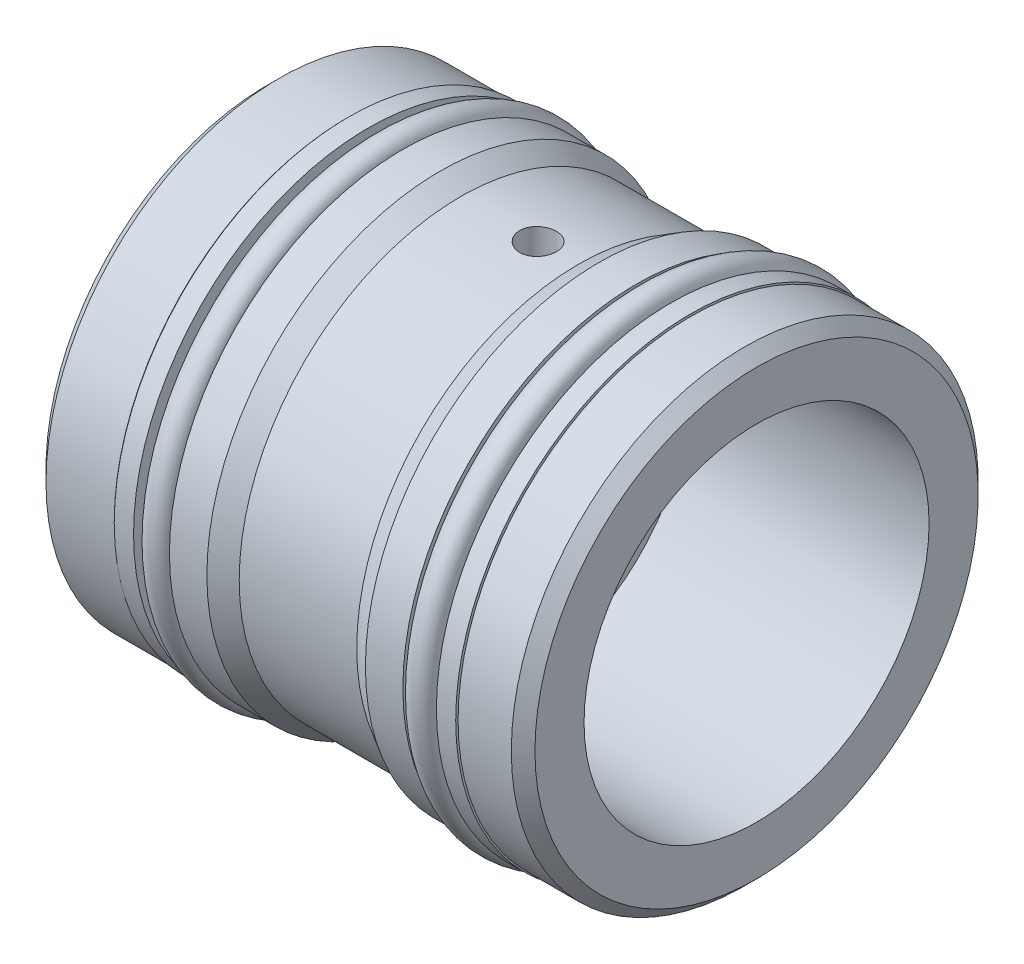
ISO-10303-21;
HEADER;
FILE_DESCRIPTION(('STEP AP214'),'2;1');
FILE_NAME('part.step','',(''),(''),'','','');
FILE_SCHEMA(('AUTOMOTIVE_DESIGN { 1 0 10303 214 1 1 1 1 }'));
ENDSEC;
DATA;
#1=APPLICATION_CONTEXT('core data for automotive mechanical design processes');
#2=APPLICATION_PROTOCOL_DEFINITION('international standard','automotive_design',2000,#1);
#3=PRODUCT_CONTEXT('',#1,'mechanical');
#4=PRODUCT('Part','Part','',(#3));
#5=PRODUCT_RELATED_PRODUCT_CATEGORY('part','',(#4));
#6=PRODUCT_DEFINITION_FORMATION('','',#4);
#7=PRODUCT_DEFINITION_CONTEXT('part definition',#1,'design');
#8=PRODUCT_DEFINITION('design','',#6,#7);
#9=PRODUCT_DEFINITION_SHAPE('','',#8);
#10=(LENGTH_UNIT() NAMED_UNIT(*) SI_UNIT(.MILLI.,.METRE.));
#11=(NAMED_UNIT(*) PLANE_ANGLE_UNIT() SI_UNIT($,.RADIAN.));
#12=(NAMED_UNIT(*) SI_UNIT($,.STERADIAN.) SOLID_ANGLE_UNIT());
#13=UNCERTAINTY_MEASURE_WITH_UNIT(LENGTH_MEASURE(1.E-05),#10,'distance_accuracy_value','');
#14=(GEOMETRIC_REPRESENTATION_CONTEXT(3) GLOBAL_UNCERTAINTY_ASSIGNED_CONTEXT((#13)) GLOBAL_UNIT_ASSIGNED_CONTEXT((#10,
#11,#12)) REPRESENTATION_CONTEXT('',''));
#15=CARTESIAN_POINT('',(0.,0.,0.));
#16=DIRECTION('',(0.,0.,1.));
#17=DIRECTION('',(1.,0.,0.));
#18=AXIS2_PLACEMENT_3D('',#15,#16,#17);
#19=CARTESIAN_POINT('',(0.,0.,0.));
#20=DIRECTION('',(-1.,0.,0.));
#21=DIRECTION('',(0.,0.,1.));
#22=AXIS2_PLACEMENT_3D('',#19,#20,#21);
#23=CYLINDRICAL_SURFACE('',#22,14.2748);
#24=CARTESIAN_POINT('',(-3.3029772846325,0.,0.));
#25=DIRECTION('',(-1.,0.,0.));
#26=DIRECTION('',(0.,0.,1.));
#27=AXIS2_PLACEMENT_3D('',#24,#25,#26);
#28=CIRCLE('',#27,14.2748);
#29=CARTESIAN_POINT('',(-3.3029772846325,0.,14.2748));
#30=VERTEX_POINT('',#29);
#31=EDGE_CURVE('E38',#30,#30,#28,.T.);
#32=ORIENTED_EDGE('',*,*,#31,.F.);
#33=EDGE_LOOP('',(#32));
#34=FACE_BOUND('',#33,.T.);
#35=CARTESIAN_POINT('',(1.6764,-14.2258538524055,1.1811));
#36=CARTESIAN_POINT('',(1.74262096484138,-14.2258545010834,1.18109710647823));
#37=CARTESIAN_POINT('',(1.80888705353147,-14.2263212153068,1.17551202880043));
#38=CARTESIAN_POINT('',(1.93958585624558,-14.2281376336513,1.1533142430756));
#39=CARTESIAN_POINT('',(2.00401640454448,-14.2294883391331,1.13668902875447));
#40=CARTESIAN_POINT('',(2.12913224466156,-14.2329187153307,1.09289497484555));
#41=CARTESIAN_POINT('',(2.18981963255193,-14.2349979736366,1.06573209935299));
#42=CARTESIAN_POINT('',(2.30575918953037,-14.2396506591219,1.00164435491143));
#43=CARTESIAN_POINT('',(2.36101251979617,-14.2422239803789,0.964721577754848));
#44=CARTESIAN_POINT('',(2.46466995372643,-14.2475821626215,0.882061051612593));
#45=CARTESIAN_POINT('',(2.51305839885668,-14.2503674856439,0.836303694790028));
#46=CARTESIAN_POINT('',(2.60147798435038,-14.2558316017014,0.737314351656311));
#47=CARTESIAN_POINT('',(2.64150876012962,-14.2585103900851,0.684082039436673));
#48=CARTESIAN_POINT('',(2.71212867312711,-14.2634639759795,0.571560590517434));
#49=CARTESIAN_POINT('',(2.74270427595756,-14.2657381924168,0.512262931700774));
#50=CARTESIAN_POINT('',(2.79345933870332,-14.2696214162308,0.389353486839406));
#51=CARTESIAN_POINT('',(2.8136389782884,-14.2712304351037,0.325741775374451));
#52=CARTESIAN_POINT('',(2.84298425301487,-14.2735987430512,0.196165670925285));
#53=CARTESIAN_POINT('',(2.8521752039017,-14.2743599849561,0.130207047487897));
#54=CARTESIAN_POINT('',(2.85936046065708,-14.2749535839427,-0.00232075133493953));
#55=CARTESIAN_POINT('',(2.85735497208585,-14.2747859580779,-0.0688899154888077));
#56=CARTESIAN_POINT('',(2.84222498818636,-14.2735423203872,-0.200577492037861));
#57=CARTESIAN_POINT('',(2.82912771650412,-14.2724685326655,-0.265699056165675));
#58=CARTESIAN_POINT('',(2.79222827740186,-14.2695359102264,-0.392816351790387));
#59=CARTESIAN_POINT('',(2.76842600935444,-14.2676770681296,-0.454812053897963));
#60=CARTESIAN_POINT('',(2.71076187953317,-14.2633796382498,-0.574004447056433));
#61=CARTESIAN_POINT('',(2.6768878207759,-14.2609403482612,-0.631195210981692));
#62=CARTESIAN_POINT('',(2.60005052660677,-14.2557561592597,-0.739089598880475));
#63=CARTESIAN_POINT('',(2.55708710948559,-14.2530112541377,-0.789793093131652));
#64=CARTESIAN_POINT('',(2.46313722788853,-14.2475146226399,-0.883432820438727));
#65=CARTESIAN_POINT('',(2.41212710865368,-14.2447629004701,-0.926345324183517));
#66=CARTESIAN_POINT('',(2.30361426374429,-14.2395710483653,-1.0030016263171));
#67=CARTESIAN_POINT('',(2.24611153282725,-14.237130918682,-1.03674541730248));
#68=CARTESIAN_POINT('',(2.12622914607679,-14.2328380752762,-1.09410550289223));
#69=CARTESIAN_POINT('',(2.0638489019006,-14.2309854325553,-1.11772057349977));
#70=CARTESIAN_POINT('',(1.93599015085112,-14.2280786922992,-1.15413534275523));
#71=CARTESIAN_POINT('',(1.87051170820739,-14.2270245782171,-1.16693526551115));
#72=CARTESIAN_POINT('',(1.73852287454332,-14.2258369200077,-1.18132637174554));
#73=CARTESIAN_POINT('',(1.67201611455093,-14.2257006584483,-1.18295064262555));
#74=CARTESIAN_POINT('',(1.53967612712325,-14.2263569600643,-1.17503100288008));
#75=CARTESIAN_POINT('',(1.47384289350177,-14.227149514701,-1.16548719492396));
#76=CARTESIAN_POINT('',(1.34481366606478,-14.2295716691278,-1.13552989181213));
#77=CARTESIAN_POINT('',(1.28161406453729,-14.2312000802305,-1.1151318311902));
#78=CARTESIAN_POINT('',(1.15953436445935,-14.2351094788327,-1.06406073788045));
#79=CARTESIAN_POINT('',(1.10065433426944,-14.2373904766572,-1.03338754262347));
#80=CARTESIAN_POINT('',(0.988733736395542,-14.2423546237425,-0.962553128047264));
#81=CARTESIAN_POINT('',(0.935707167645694,-14.245038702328,-0.922369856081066));
#82=CARTESIAN_POINT('',(0.837140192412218,-14.2505034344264,-0.833687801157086));
#83=CARTESIAN_POINT('',(0.791599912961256,-14.253284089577,-0.785188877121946));
#84=CARTESIAN_POINT('',(0.709185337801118,-14.2586367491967,-0.681109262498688));
#85=CARTESIAN_POINT('',(0.672332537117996,-14.2612082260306,-0.625511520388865));
#86=CARTESIAN_POINT('',(0.60848650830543,-14.2658451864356,-0.50889747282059));
#87=CARTESIAN_POINT('',(0.581493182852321,-14.2679106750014,-0.447881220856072));
#88=CARTESIAN_POINT('',(0.538169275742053,-14.2713005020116,-0.322239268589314));
#89=CARTESIAN_POINT('',(0.521825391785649,-14.272625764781,-0.257618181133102));
#90=CARTESIAN_POINT('',(0.500220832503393,-14.2743895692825,-0.126537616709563));
#91=CARTESIAN_POINT('',(0.494959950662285,-14.2748281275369,-0.0600781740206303));
#92=CARTESIAN_POINT('',(0.495673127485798,-14.2747691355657,0.0725806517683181));
#93=CARTESIAN_POINT('',(0.501613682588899,-14.2742743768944,0.138780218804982));
#94=CARTESIAN_POINT('',(0.524491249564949,-14.2724098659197,0.269238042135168));
#95=CARTESIAN_POINT('',(0.541428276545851,-14.2710401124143,0.33349629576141));
#96=CARTESIAN_POINT('',(0.585809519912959,-14.2675793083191,0.458249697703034));
#97=CARTESIAN_POINT('',(0.613253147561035,-14.2654882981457,0.518745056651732));
#98=CARTESIAN_POINT('',(0.677864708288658,-14.2608189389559,0.634275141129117));
#99=CARTESIAN_POINT('',(0.715032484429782,-14.2582405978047,0.689309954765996));
#100=CARTESIAN_POINT('',(0.79816301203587,-14.25287681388,0.79252814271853));
#101=CARTESIAN_POINT('',(0.844150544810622,-14.2500908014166,0.840691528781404));
#102=CARTESIAN_POINT('',(0.943570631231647,-14.2446305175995,0.928635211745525));
#103=CARTESIAN_POINT('',(0.997004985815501,-14.2419562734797,0.968413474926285));
#104=CARTESIAN_POINT('',(1.10990422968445,-14.237016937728,1.03851079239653));
#105=CARTESIAN_POINT('',(1.16938010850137,-14.2347526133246,1.0688121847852));
#106=CARTESIAN_POINT('',(1.29255353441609,-14.2308988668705,1.11895973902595));
#107=CARTESIAN_POINT('',(1.35624612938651,-14.2293086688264,1.13881792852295));
#108=CARTESIAN_POINT('',(1.46299578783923,-14.2273924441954,1.16245437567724));
#109=CARTESIAN_POINT('',(1.5053661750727,-14.2268181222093,1.16943719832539));
#110=CARTESIAN_POINT('',(1.59061806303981,-14.2260486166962,1.17876094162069));
#111=CARTESIAN_POINT('',(1.63349956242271,-14.2258534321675,1.18110187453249));
#112=CARTESIAN_POINT('',(1.6764,-14.2258538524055,1.1811));
#113=B_SPLINE_CURVE_WITH_KNOTS('',3,(#35,#36,#37,#38,#39,#40,#41,#42,#43,#44,#45,#46,#47,#48,
#49,#50,#51,#52,#53,#54,#55,#56,#57,#58,#59,#60,#61,#62,#63,#64,#65,#66,#67,#68,#69,#70,#71,#72,
#73,#74,#75,#76,#77,#78,#79,#80,#81,#82,#83,#84,#85,#86,#87,#88,#89,#90,#91,#92,#93,#94,#95,#96,
#97,#98,#99,#100,#101,#102,#103,#104,#105,#106,#107,#108,#109,#110,#111,#112),.UNSPECIFIED.,.T.,
.F.,(4,2,2,2,2,2,2,2,2,2,2,2,2,2,2,2,2,2,2,2,2,2,2,2,2,2,2,2,2,2,2,2,2,2,2,2,2,2,4),(0.,
0.198506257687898,0.397237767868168,0.595856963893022,0.794433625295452,0.993456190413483,
1.1924874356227,1.39180227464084,1.59111366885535,1.78996499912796,1.98881267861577,
2.18717371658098,2.38553661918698,2.58414072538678,2.78274880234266,2.98195199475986,
3.18115534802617,3.38038276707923,3.57960605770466,3.77823925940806,3.97687063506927,
4.17522031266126,4.3735731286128,4.57239048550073,4.77121121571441,4.97051883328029,
5.16982448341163,5.3688806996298,5.5679332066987,5.76639129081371,5.96484964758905,
6.16329688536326,6.36174092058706,6.5607509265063,6.75980914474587,6.95923616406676,
7.15843299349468,7.28703317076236,7.41563300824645),.UNSPECIFIED.);
#114=CARTESIAN_POINT('',(1.6764,-14.2258538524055,1.1811));
#115=VERTEX_POINT('',#114);
#116=EDGE_CURVE('E49',#115,#115,#113,.T.);
#117=ORIENTED_EDGE('',*,*,#116,.T.);
#118=EDGE_LOOP('',(#117));
#119=FACE_BOUND('',#118,.T.);
#120=CARTESIAN_POINT('',(1.6764,14.2258538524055,1.1811));
#121=CARTESIAN_POINT('',(1.61017903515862,14.2258545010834,1.18109710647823));
#122=CARTESIAN_POINT('',(1.54391294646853,14.2263212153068,1.17551202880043));
#123=CARTESIAN_POINT('',(1.41321414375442,14.2281376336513,1.1533142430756));
#124=CARTESIAN_POINT('',(1.34878359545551,14.2294883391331,1.13668902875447));
#125=CARTESIAN_POINT('',(1.22366775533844,14.2329187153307,1.09289497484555));
#126=CARTESIAN_POINT('',(1.16298036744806,14.2349979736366,1.06573209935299));
#127=CARTESIAN_POINT('',(1.04704081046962,14.2396506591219,1.00164435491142));
#128=CARTESIAN_POINT('',(0.991787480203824,14.2422239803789,0.964721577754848));
#129=CARTESIAN_POINT('',(0.888130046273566,14.2475821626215,0.882061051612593));
#130=CARTESIAN_POINT('',(0.839741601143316,14.2503674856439,0.836303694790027));
#131=CARTESIAN_POINT('',(0.751322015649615,14.2558316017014,0.737314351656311));
#132=CARTESIAN_POINT('',(0.71129123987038,14.2585103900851,0.684082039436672));
#133=CARTESIAN_POINT('',(0.640671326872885,14.2634639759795,0.571560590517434));
#134=CARTESIAN_POINT('',(0.610095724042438,14.2657381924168,0.512262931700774));
#135=CARTESIAN_POINT('',(0.559340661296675,14.2696214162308,0.389353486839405));
#136=CARTESIAN_POINT('',(0.539161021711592,14.2712304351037,0.32574177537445));
#137=CARTESIAN_POINT('',(0.509815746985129,14.2735987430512,0.196165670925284));
#138=CARTESIAN_POINT('',(0.500624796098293,14.2743599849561,0.130207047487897));
#139=CARTESIAN_POINT('',(0.493439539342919,14.2749535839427,-0.00232075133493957));
#140=CARTESIAN_POINT('',(0.49544502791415,14.2747859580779,-0.0688899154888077));
#141=CARTESIAN_POINT('',(0.510575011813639,14.2735423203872,-0.200577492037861));
#142=CARTESIAN_POINT('',(0.523672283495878,14.2724685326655,-0.265699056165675));
#143=CARTESIAN_POINT('',(0.560571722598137,14.2695359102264,-0.392816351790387));
#144=CARTESIAN_POINT('',(0.584373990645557,14.2676770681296,-0.454812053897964));
#145=CARTESIAN_POINT('',(0.642038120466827,14.2633796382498,-0.574004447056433));
#146=CARTESIAN_POINT('',(0.675912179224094,14.2609403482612,-0.631195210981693));
#147=CARTESIAN_POINT('',(0.752749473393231,14.2557561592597,-0.739089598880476));
#148=CARTESIAN_POINT('',(0.795712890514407,14.2530112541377,-0.789793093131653));
#149=CARTESIAN_POINT('',(0.889662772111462,14.2475146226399,-0.883432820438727));
#150=CARTESIAN_POINT('',(0.940672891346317,14.2447629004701,-0.926345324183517));
#151=CARTESIAN_POINT('',(1.04918573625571,14.2395710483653,-1.0030016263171));
#152=CARTESIAN_POINT('',(1.10668846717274,14.237130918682,-1.03674541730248));
#153=CARTESIAN_POINT('',(1.2265708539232,14.2328380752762,-1.09410550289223));
#154=CARTESIAN_POINT('',(1.2889510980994,14.2309854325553,-1.11772057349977));
#155=CARTESIAN_POINT('',(1.41680984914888,14.2280786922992,-1.15413534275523));
#156=CARTESIAN_POINT('',(1.4822882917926,14.2270245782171,-1.16693526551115));
#157=CARTESIAN_POINT('',(1.61427712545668,14.2258369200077,-1.18132637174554));
#158=CARTESIAN_POINT('',(1.68078388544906,14.2257006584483,-1.18295064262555));
#159=CARTESIAN_POINT('',(1.81312387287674,14.2263569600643,-1.17503100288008));
#160=CARTESIAN_POINT('',(1.87895710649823,14.227149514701,-1.16548719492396));
#161=CARTESIAN_POINT('',(2.00798633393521,14.2295716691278,-1.13552989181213));
#162=CARTESIAN_POINT('',(2.07118593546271,14.2312000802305,-1.1151318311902));
#163=CARTESIAN_POINT('',(2.19326563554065,14.2351094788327,-1.06406073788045));
#164=CARTESIAN_POINT('',(2.25214566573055,14.2373904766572,-1.03338754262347));
#165=CARTESIAN_POINT('',(2.36406626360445,14.2423546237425,-0.962553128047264));
#166=CARTESIAN_POINT('',(2.4170928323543,14.245038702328,-0.922369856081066));
#167=CARTESIAN_POINT('',(2.51565980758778,14.2505034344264,-0.833687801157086));
#168=CARTESIAN_POINT('',(2.56120008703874,14.253284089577,-0.785188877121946));
#169=CARTESIAN_POINT('',(2.64361466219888,14.2586367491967,-0.681109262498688));
#170=CARTESIAN_POINT('',(2.680467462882,14.2612082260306,-0.625511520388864));
#171=CARTESIAN_POINT('',(2.74431349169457,14.2658451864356,-0.50889747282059));
#172=CARTESIAN_POINT('',(2.77130681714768,14.2679106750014,-0.447881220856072));
#173=CARTESIAN_POINT('',(2.81463072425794,14.2713005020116,-0.322239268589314));
#174=CARTESIAN_POINT('',(2.83097460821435,14.272625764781,-0.257618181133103));
#175=CARTESIAN_POINT('',(2.8525791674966,14.2743895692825,-0.126537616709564));
#176=CARTESIAN_POINT('',(2.85784004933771,14.2748281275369,-0.0600781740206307));
#177=CARTESIAN_POINT('',(2.8571268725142,14.2747691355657,0.072580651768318));
#178=CARTESIAN_POINT('',(2.8511863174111,14.2742743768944,0.138780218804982));
#179=CARTESIAN_POINT('',(2.82830875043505,14.2724098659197,0.269238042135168));
#180=CARTESIAN_POINT('',(2.81137172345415,14.2710401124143,0.33349629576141));
#181=CARTESIAN_POINT('',(2.76699048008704,14.2675793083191,0.458249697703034));
#182=CARTESIAN_POINT('',(2.73954685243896,14.2654882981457,0.518745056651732));
#183=CARTESIAN_POINT('',(2.67493529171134,14.2608189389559,0.634275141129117));
#184=CARTESIAN_POINT('',(2.63776751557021,14.2582405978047,0.689309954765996));
#185=CARTESIAN_POINT('',(2.55463698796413,14.25287681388,0.79252814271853));
#186=CARTESIAN_POINT('',(2.50864945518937,14.2500908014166,0.840691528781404));
#187=CARTESIAN_POINT('',(2.40922936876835,14.2446305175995,0.928635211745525));
#188=CARTESIAN_POINT('',(2.35579501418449,14.2419562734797,0.968413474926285));
#189=CARTESIAN_POINT('',(2.24289577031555,14.237016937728,1.03851079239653));
#190=CARTESIAN_POINT('',(2.18341989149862,14.2347526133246,1.0688121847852));
#191=CARTESIAN_POINT('',(2.06024646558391,14.2308988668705,1.11895973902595));
#192=CARTESIAN_POINT('',(1.99655387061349,14.2293086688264,1.13881792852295));
#193=CARTESIAN_POINT('',(1.88980421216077,14.2273924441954,1.16245437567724));
#194=CARTESIAN_POINT('',(1.8474338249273,14.2268181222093,1.16943719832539));
#195=CARTESIAN_POINT('',(1.76218193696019,14.2260486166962,1.17876094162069));
#196=CARTESIAN_POINT('',(1.71930043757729,14.2258534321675,1.18110187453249));
#197=CARTESIAN_POINT('',(1.6764,14.2258538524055,1.1811));
#198=B_SPLINE_CURVE_WITH_KNOTS('',3,(#120,#121,#122,#123,#124,#125,#126,#127,#128,#129,#130,
#131,#132,#133,#134,#135,#136,#137,#138,#139,#140,#141,#142,#143,#144,#145,#146,#147,#148,#149,
#150,#151,#152,#153,#154,#155,#156,#157,#158,#159,#160,#161,#162,#163,#164,#165,#166,#167,#168,
#169,#170,#171,#172,#173,#174,#175,#176,#177,#178,#179,#180,#181,#182,#183,#184,#185,#186,#187,
#188,#189,#190,#191,#192,#193,#194,#195,#196,#197),.UNSPECIFIED.,.T.,.F.,(4,2,2,2,2,2,2,2,2,2,2,
2,2,2,2,2,2,2,2,2,2,2,2,2,2,2,2,2,2,2,2,2,2,2,2,2,2,2,4),(0.,0.198506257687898,
0.397237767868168,0.595856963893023,0.794433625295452,0.993456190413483,1.1924874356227,
1.39180227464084,1.59111366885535,1.78996499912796,1.98881267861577,2.18717371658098,
2.38553661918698,2.58414072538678,2.78274880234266,2.98195199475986,3.18115534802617,
3.38038276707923,3.57960605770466,3.77823925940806,3.97687063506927,4.17522031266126,
4.3735731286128,4.57239048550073,4.77121121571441,4.97051883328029,5.16982448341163,
5.3688806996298,5.5679332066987,5.76639129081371,5.96484964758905,6.16329688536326,
6.36174092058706,6.5607509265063,6.75980914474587,6.95923616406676,7.15843299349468,
7.28703317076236,7.41563300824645),.UNSPECIFIED.);
#199=CARTESIAN_POINT('',(1.6764,14.2258538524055,1.1811));
#200=VERTEX_POINT('',#199);
#201=EDGE_CURVE('E57',#200,#200,#198,.T.);
#202=ORIENTED_EDGE('',*,*,#201,.T.);
#203=EDGE_LOOP('',(#202));
#204=FACE_BOUND('',#203,.T.);
#205=CARTESIAN_POINT('',(4.2681772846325,0.,0.));
#206=DIRECTION('',(1.,0.,0.));
#207=DIRECTION('',(0.,0.,-1.));
#208=AXIS2_PLACEMENT_3D('',#205,#206,#207);
#209=CIRCLE('',#208,14.2748);
#210=CARTESIAN_POINT('',(4.2681772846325,0.,-14.2748));
#211=VERTEX_POINT('',#210);
#212=EDGE_CURVE('E10',#211,#211,#209,.T.);
#213=ORIENTED_EDGE('',*,*,#212,.F.);
#214=EDGE_LOOP('',(#213));
#215=FACE_BOUND('',#214,.T.);
#216=ADVANCED_FACE('F31',(#34,#119,#204,#215),#23,.T.);
#217=CARTESIAN_POINT('',(0.,0.,0.));
#218=DIRECTION('',(-1.,0.,0.));
#219=DIRECTION('',(0.,0.,1.));
#220=AXIS2_PLACEMENT_3D('',#217,#218,#219);
#221=CYLINDRICAL_SURFACE('',#220,13.7668);
#222=CARTESIAN_POINT('',(9.32630715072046,0.,0.));
#223=DIRECTION('',(-1.,0.,0.));
#224=DIRECTION('',(0.,0.,1.));
#225=AXIS2_PLACEMENT_3D('',#222,#223,#224);
#226=CIRCLE('',#225,13.7668);
#227=CARTESIAN_POINT('',(9.32630715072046,0.,13.7668));
#228=VERTEX_POINT('',#227);
#229=EDGE_CURVE('E207',#228,#228,#226,.T.);
#230=ORIENTED_EDGE('',*,*,#229,.F.);
#231=EDGE_LOOP('',(#230));
#232=FACE_BOUND('',#231,.T.);
#233=CARTESIAN_POINT('',(10.2362,0.,0.));
#234=DIRECTION('',(1.,0.,0.));
#235=DIRECTION('',(0.,0.,-1.));
#236=AXIS2_PLACEMENT_3D('',#233,#234,#235);
#237=CIRCLE('',#236,13.7668);
#238=CARTESIAN_POINT('',(10.2362,0.,-13.7668));
#239=VERTEX_POINT('',#238);
#240=EDGE_CURVE('E42',#239,#239,#237,.T.);
#241=ORIENTED_EDGE('',*,*,#240,.F.);
#242=EDGE_LOOP('',(#241));
#243=FACE_BOUND('',#242,.T.);
#244=ADVANCED_FACE('F122',(#232,#243),#221,.T.);
#245=CARTESIAN_POINT('',(11.557,0.,0.));
#246=DIRECTION('',(-1.,0.,0.));
#247=DIRECTION('',(0.,0.,1.));
#248=AXIS2_PLACEMENT_3D('',#245,#246,#247);
#249=CIRCLE('',#248,13.7668);
#250=CARTESIAN_POINT('',(11.557,0.,13.7668));
#251=VERTEX_POINT('',#250);
#252=EDGE_CURVE('E168',#251,#251,#249,.T.);
#253=ORIENTED_EDGE('',*,*,#252,.T.);
#254=EDGE_LOOP('',(#253));
#255=FACE_BOUND('',#254,.T.);
#256=CARTESIAN_POINT('',(11.4808,0.,0.));
#257=DIRECTION('',(-1.,0.,0.));
#258=DIRECTION('',(0.,0.,1.));
#259=AXIS2_PLACEMENT_3D('',#256,#257,#258);
#260=CIRCLE('',#259,13.7668);
#261=CARTESIAN_POINT('',(11.4808,0.,13.7668));
#262=VERTEX_POINT('',#261);
#263=EDGE_CURVE('E46',#262,#262,#260,.T.);
#264=ORIENTED_EDGE('',*,*,#263,.F.);
#265=EDGE_LOOP('',(#264));
#266=FACE_BOUND('',#265,.T.);
#267=ADVANCED_FACE('F127',(#255,#266),#221,.T.);
#268=CARTESIAN_POINT('',(8.001,0.,0.));
#269=DIRECTION('',(-1.,0.,0.));
#270=DIRECTION('',(0.,0.,1.));
#271=AXIS2_PLACEMENT_3D('',#268,#269,#270);
#272=CIRCLE('',#271,13.7668);
#273=CARTESIAN_POINT('',(8.001,0.,13.7668));
#274=VERTEX_POINT('',#273);
#275=EDGE_CURVE('E159',#274,#274,#272,.T.);
#276=ORIENTED_EDGE('',*,*,#275,.F.);
#277=EDGE_LOOP('',(#276));
#278=FACE_BOUND('',#277,.T.);
#279=CARTESIAN_POINT('',(8.60609284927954,0.,0.));
#280=DIRECTION('',(1.,0.,0.));
#281=DIRECTION('',(0.,0.,-1.));
#282=AXIS2_PLACEMENT_3D('',#279,#280,#281);
#283=CIRCLE('',#282,13.7668);
#284=CARTESIAN_POINT('',(8.60609284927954,0.,-13.7668));
#285=VERTEX_POINT('',#284);
#286=EDGE_CURVE('E210',#285,#285,#283,.T.);
#287=ORIENTED_EDGE('',*,*,#286,.F.);
#288=EDGE_LOOP('',(#287));
#289=FACE_BOUND('',#288,.T.);
#290=ADVANCED_FACE('F130',(#278,#289),#221,.T.);
#291=CARTESIAN_POINT('',(0.,0.,0.));
#292=DIRECTION('',(-1.,0.,0.));
#293=DIRECTION('',(0.,0.,1.));
#294=AXIS2_PLACEMENT_3D('',#291,#292,#293);
#295=CYLINDRICAL_SURFACE('',#294,13.7668);
#296=CARTESIAN_POINT('',(-9.271,0.,0.));
#297=DIRECTION('',(-1.,0.,0.));
#298=DIRECTION('',(0.,0.,1.));
#299=AXIS2_PLACEMENT_3D('',#296,#297,#298);
#300=CIRCLE('',#299,13.7668);
#301=CARTESIAN_POINT('',(-9.271,0.,13.7668));
#302=VERTEX_POINT('',#301);
#303=EDGE_CURVE('E195',#302,#302,#300,.T.);
#304=ORIENTED_EDGE('',*,*,#303,.F.);
#305=EDGE_LOOP('',(#304));
#306=FACE_BOUND('',#305,.T.);
#307=CARTESIAN_POINT('',(-8.36110715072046,0.,0.));
#308=DIRECTION('',(1.,0.,0.));
#309=DIRECTION('',(0.,0.,-1.));
#310=AXIS2_PLACEMENT_3D('',#307,#308,#309);
#311=CIRCLE('',#310,13.7668);
#312=CARTESIAN_POINT('',(-8.36110715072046,0.,-13.7668));
#313=VERTEX_POINT('',#312);
#314=EDGE_CURVE('E204',#313,#313,#311,.T.);
#315=ORIENTED_EDGE('',*,*,#314,.F.);
#316=EDGE_LOOP('',(#315));
#317=FACE_BOUND('',#316,.T.);
#318=ADVANCED_FACE('F222',(#306,#317),#295,.T.);
#319=CARTESIAN_POINT('',(-7.0358,0.,0.));
#320=DIRECTION('',(-1.,0.,0.));
#321=DIRECTION('',(0.,0.,1.));
#322=AXIS2_PLACEMENT_3D('',#319,#320,#321);
#323=CIRCLE('',#322,13.7668);
#324=CARTESIAN_POINT('',(-7.0358,0.,13.7668));
#325=VERTEX_POINT('',#324);
#326=EDGE_CURVE('E162',#325,#325,#323,.T.);
#327=ORIENTED_EDGE('',*,*,#326,.T.);
#328=EDGE_LOOP('',(#327));
#329=FACE_BOUND('',#328,.T.);
#330=CARTESIAN_POINT('',(-7.64089284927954,0.,0.));
#331=DIRECTION('',(-1.,0.,0.));
#332=DIRECTION('',(0.,0.,1.));
#333=AXIS2_PLACEMENT_3D('',#330,#331,#332);
#334=CIRCLE('',#333,13.7668);
#335=CARTESIAN_POINT('',(-7.64089284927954,0.,13.7668));
#336=VERTEX_POINT('',#335);
#337=EDGE_CURVE('E201',#336,#336,#334,.T.);
#338=ORIENTED_EDGE('',*,*,#337,.F.);
#339=EDGE_LOOP('',(#338));
#340=FACE_BOUND('',#339,.T.);
#341=ADVANCED_FACE('F270',(#329,#340),#295,.T.);
#342=CARTESIAN_POINT('',(-10.5918,0.,0.));
#343=DIRECTION('',(-1.,0.,0.));
#344=DIRECTION('',(0.,0.,1.));
#345=AXIS2_PLACEMENT_3D('',#342,#343,#344);
#346=CIRCLE('',#345,13.7668);
#347=CARTESIAN_POINT('',(-10.5918,0.,13.7668));
#348=VERTEX_POINT('',#347);
#349=EDGE_CURVE('E259',#348,#348,#346,.T.);
#350=ORIENTED_EDGE('',*,*,#349,.F.);
#351=EDGE_LOOP('',(#350));
#352=FACE_BOUND('',#351,.T.);
#353=CARTESIAN_POINT('',(-10.5156,0.,0.));
#354=DIRECTION('',(1.,0.,0.));
#355=DIRECTION('',(0.,0.,-1.));
#356=AXIS2_PLACEMENT_3D('',#353,#354,#355);
#357=CIRCLE('',#356,13.7668);
#358=CARTESIAN_POINT('',(-10.5156,0.,-13.7668));
#359=VERTEX_POINT('',#358);
#360=EDGE_CURVE('E198',#359,#359,#357,.T.);
#361=ORIENTED_EDGE('',*,*,#360,.F.);
#362=EDGE_LOOP('',(#361));
#363=FACE_BOUND('',#362,.T.);
#364=ADVANCED_FACE('F104',(#352,#363),#295,.T.);
#365=CARTESIAN_POINT('',(0.,0.,0.));
#366=DIRECTION('',(-1.,0.,0.));
#367=DIRECTION('',(0.,0.,1.));
#368=AXIS2_PLACEMENT_3D('',#365,#366,#367);
#369=CYLINDRICAL_SURFACE('',#368,6.35);
#370=CARTESIAN_POINT('',(0.355599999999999,0.,0.));
#371=DIRECTION('',(-1.,0.,0.));
#372=DIRECTION('',(0.,0.,1.));
#373=AXIS2_PLACEMENT_3D('',#370,#371,#372);
#374=CIRCLE('',#373,6.35);
#375=CARTESIAN_POINT('',(0.355599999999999,0.,6.35));
#376=VERTEX_POINT('',#375);
#377=EDGE_CURVE('E180',#376,#376,#374,.T.);
#378=ORIENTED_EDGE('',*,*,#377,.F.);
#379=EDGE_LOOP('',(#378));
#380=FACE_BOUND('',#379,.T.);
#381=CARTESIAN_POINT('',(-15.748,0.,0.));
#382=DIRECTION('',(-1.,0.,0.));
#383=DIRECTION('',(0.,0.,1.));
#384=AXIS2_PLACEMENT_3D('',#381,#382,#383);
#385=CIRCLE('',#384,6.35);
#386=CARTESIAN_POINT('',(-15.748,0.,6.35));
#387=VERTEX_POINT('',#386);
#388=EDGE_CURVE('E253',#387,#387,#385,.T.);
#389=ORIENTED_EDGE('',*,*,#388,.T.);
#390=EDGE_LOOP('',(#389));
#391=FACE_BOUND('',#390,.T.);
#392=ADVANCED_FACE('F101',(#380,#391),#369,.F.);
#393=CARTESIAN_POINT('',(0.355599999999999,6.35,0.));
#394=DIRECTION('',(-1.,0.,0.));
#395=DIRECTION('',(0.,0.,1.));
#396=AXIS2_PLACEMENT_3D('',#393,#394,#395);
#397=PLANE('',#396);
#398=CARTESIAN_POINT('',(0.355599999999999,0.,0.));
#399=DIRECTION('',(-1.,0.,0.));
#400=DIRECTION('',(0.,0.,1.));
#401=AXIS2_PLACEMENT_3D('',#398,#399,#400);
#402=CIRCLE('',#401,11.1125);
#403=CARTESIAN_POINT('',(0.355599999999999,0.,11.1125));
#404=VERTEX_POINT('',#403);
#405=EDGE_CURVE('E177',#404,#404,#402,.T.);
#406=ORIENTED_EDGE('',*,*,#405,.F.);
#407=EDGE_LOOP('',(#406));
#408=FACE_BOUND('',#407,.T.);
#409=ORIENTED_EDGE('',*,*,#377,.T.);
#410=EDGE_LOOP('',(#409));
#411=FACE_BOUND('',#410,.T.);
#412=ADVANCED_FACE('F95',(#408,#411),#397,.F.);
#413=CARTESIAN_POINT('',(0.,0.,0.));
#414=DIRECTION('',(-1.,0.,0.));
#415=DIRECTION('',(0.,0.,1.));
#416=AXIS2_PLACEMENT_3D('',#413,#414,#415);
#417=CYLINDRICAL_SURFACE('',#416,11.1125);
#418=CARTESIAN_POINT('',(1.6764,-11.0495546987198,1.1811));
#419=CARTESIAN_POINT('',(1.61025843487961,-11.0495555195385,1.18109714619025));
#420=CARTESIAN_POINT('',(1.5440736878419,-11.0501549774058,1.17552539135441));
#421=CARTESIAN_POINT('',(1.4135407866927,-11.0524875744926,1.15338363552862));
#422=CARTESIAN_POINT('',(1.34919471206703,-11.054221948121,1.13680165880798));
#423=CARTESIAN_POINT('',(1.22424827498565,-11.0586257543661,1.09312916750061));
#424=CARTESIAN_POINT('',(1.16364560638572,-11.0612946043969,1.06604519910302));
#425=CARTESIAN_POINT('',(1.04785884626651,-11.0672659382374,1.00215046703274));
#426=CARTESIAN_POINT('',(0.992673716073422,-11.0705683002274,0.965341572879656));
#427=CARTESIAN_POINT('',(0.889050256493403,-11.0774496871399,0.882880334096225));
#428=CARTESIAN_POINT('',(0.840637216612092,-11.0810296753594,0.837196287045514));
#429=CARTESIAN_POINT('',(0.752150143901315,-11.0880542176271,0.73834944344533));
#430=CARTESIAN_POINT('',(0.712076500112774,-11.0914987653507,0.685186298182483));
#431=CARTESIAN_POINT('',(0.641317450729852,-11.097873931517,0.57273433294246));
#432=CARTESIAN_POINT('',(0.610654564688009,-11.1008033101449,0.5134312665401));
#433=CARTESIAN_POINT('',(0.559731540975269,-11.105807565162,0.39048157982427));
#434=CARTESIAN_POINT('',(0.53947111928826,-11.1078824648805,0.326835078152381));
#435=CARTESIAN_POINT('',(0.510002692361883,-11.1109372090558,0.197261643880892));
#436=CARTESIAN_POINT('',(0.500753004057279,-11.1119211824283,0.131344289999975));
#437=CARTESIAN_POINT('',(0.493439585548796,-11.11269726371,-0.00111401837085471));
#438=CARTESIAN_POINT('',(0.495375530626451,-11.1124894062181,-0.0676549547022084));
#439=CARTESIAN_POINT('',(0.510344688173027,-11.1109086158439,-0.199188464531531));
#440=CARTESIAN_POINT('',(0.523333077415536,-11.1095403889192,-0.264186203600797));
#441=CARTESIAN_POINT('',(0.559968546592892,-11.1057979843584,-0.391074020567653));
#442=CARTESIAN_POINT('',(0.583615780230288,-11.1034237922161,-0.45296405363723));
#443=CARTESIAN_POINT('',(0.640946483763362,-11.0979282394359,-0.572020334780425));
#444=CARTESIAN_POINT('',(0.674649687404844,-11.0948054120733,-0.629177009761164));
#445=CARTESIAN_POINT('',(0.751121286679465,-11.088162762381,-0.73703965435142));
#446=CARTESIAN_POINT('',(0.793889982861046,-11.0846429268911,-0.787745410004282));
#447=CARTESIAN_POINT('',(0.887530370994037,-11.0775804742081,-0.881529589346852));
#448=CARTESIAN_POINT('',(0.938441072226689,-11.0740378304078,-0.924569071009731));
#449=CARTESIAN_POINT('',(1.04678534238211,-11.0673463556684,-1.00149721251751));
#450=CARTESIAN_POINT('',(1.10421892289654,-11.0641975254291,-1.0353858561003));
#451=CARTESIAN_POINT('',(1.22400964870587,-11.0586500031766,-1.09305071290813));
#452=CARTESIAN_POINT('',(1.28636804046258,-11.0562515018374,-1.11682435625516));
#453=CARTESIAN_POINT('',(1.41422273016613,-11.0524801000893,-1.15355269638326));
#454=CARTESIAN_POINT('',(1.479718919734,-11.0511071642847,-1.16650776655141));
#455=CARTESIAN_POINT('',(1.61164766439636,-11.0495485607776,-1.1811807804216));
#456=CARTESIAN_POINT('',(1.67807408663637,-11.049357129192,-1.1829532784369));
#457=CARTESIAN_POINT('',(1.81027809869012,-11.0501679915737,-1.17535425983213));
#458=CARTESIAN_POINT('',(1.87605569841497,-11.0511702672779,-1.16598291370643));
#459=CARTESIAN_POINT('',(2.00493483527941,-11.0542503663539,-1.13640793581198));
#460=CARTESIAN_POINT('',(2.0680423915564,-11.0563256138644,-1.11623024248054));
#461=CARTESIAN_POINT('',(2.18997742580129,-11.0613157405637,-1.0656418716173));
#462=CARTESIAN_POINT('',(2.248804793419,-11.0642306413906,-1.03523093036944));
#463=CARTESIAN_POINT('',(2.36075779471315,-11.07058556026,-0.964903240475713));
#464=CARTESIAN_POINT('',(2.41386065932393,-11.0740275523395,-0.924950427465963));
#465=CARTESIAN_POINT('',(2.51262603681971,-11.0810424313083,-0.836724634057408));
#466=CARTESIAN_POINT('',(2.55828834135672,-11.0846153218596,-0.788451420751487));
#467=CARTESIAN_POINT('',(2.64106535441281,-11.091506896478,-0.684718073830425));
#468=CARTESIAN_POINT('',(2.67814441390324,-11.0948244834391,-0.629229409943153));
#469=CARTESIAN_POINT('',(2.74245677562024,-11.1008155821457,-0.512780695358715));
#470=CARTESIAN_POINT('',(2.7696902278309,-11.1034891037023,-0.451820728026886));
#471=CARTESIAN_POINT('',(2.81347826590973,-11.1078859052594,-0.326282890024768));
#472=CARTESIAN_POINT('',(2.83005416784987,-11.1096110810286,-0.261712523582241));
#473=CARTESIAN_POINT('',(2.8521260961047,-11.1119246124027,-0.130685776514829));
#474=CARTESIAN_POINT('',(2.8576224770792,-11.1125130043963,-0.0642294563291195));
#475=CARTESIAN_POINT('',(2.85737398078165,-11.1124866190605,0.068333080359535));
#476=CARTESIAN_POINT('',(2.85168435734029,-11.1118777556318,0.134439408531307));
#477=CARTESIAN_POINT('',(2.82934149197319,-11.1095369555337,0.264751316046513));
#478=CARTESIAN_POINT('',(2.81268824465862,-11.1078050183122,0.328956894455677));
#479=CARTESIAN_POINT('',(2.76890665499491,-11.1034120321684,0.453642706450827));
#480=CARTESIAN_POINT('',(2.7417801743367,-11.1007511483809,0.514123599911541));
#481=CARTESIAN_POINT('',(2.6778279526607,-11.0947964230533,0.62968276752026));
#482=CARTESIAN_POINT('',(2.64100222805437,-11.0915025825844,0.684761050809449));
#483=CARTESIAN_POINT('',(2.55849016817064,-11.0846311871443,0.788234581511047));
#484=CARTESIAN_POINT('',(2.51276266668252,-11.0810523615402,0.836596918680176));
#485=CARTESIAN_POINT('',(2.41382775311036,-11.0740249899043,0.924985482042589));
#486=CARTESIAN_POINT('',(2.36061855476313,-11.0705764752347,0.96500971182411));
#487=CARTESIAN_POINT('',(2.24806302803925,-11.0641897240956,1.03567775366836));
#488=CARTESIAN_POINT('',(2.18869971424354,-11.0612529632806,1.06629462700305));
#489=CARTESIAN_POINT('',(2.06568010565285,-11.0562397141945,1.11708410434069));
#490=CARTESIAN_POINT('',(2.00202870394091,-11.054162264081,1.13726839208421));
#491=CARTESIAN_POINT('',(1.89441976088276,-11.051622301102,1.16163240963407));
#492=CARTESIAN_POINT('',(1.85114823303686,-11.0508506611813,1.16892266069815));
#493=CARTESIAN_POINT('',(1.76405745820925,-11.0498165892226,1.17865738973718));
#494=CARTESIAN_POINT('',(1.7202382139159,-11.0495541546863,1.18110189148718));
#495=CARTESIAN_POINT('',(1.6764,-11.0495546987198,1.1811));
#496=B_SPLINE_CURVE_WITH_KNOTS('',3,(#418,#419,#420,#421,#422,#423,#424,#425,#426,#427,#428,
#429,#430,#431,#432,#433,#434,#435,#436,#437,#438,#439,#440,#441,#442,#443,#444,#445,#446,#447,
#448,#449,#450,#451,#452,#453,#454,#455,#456,#457,#458,#459,#460,#461,#462,#463,#464,#465,#466,
#467,#468,#469,#470,#471,#472,#473,#474,#475,#476,#477,#478,#479,#480,#481,#482,#483,#484,#485,
#486,#487,#488,#489,#490,#491,#492,#493,#494,#495),.UNSPECIFIED.,.T.,.F.,(4,2,2,2,2,2,2,2,2,2,2,
2,2,2,2,2,2,2,2,2,2,2,2,2,2,2,2,2,2,2,2,2,2,2,2,2,2,2,4),(0.,0.198264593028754,
0.396745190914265,0.595102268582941,0.793421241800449,0.99246209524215,1.19151223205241,
1.39103503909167,1.59055239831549,1.78931202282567,1.98806587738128,2.18601750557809,
2.38397198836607,2.58231751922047,2.78066962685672,2.98000221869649,3.17933516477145,
3.37871872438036,3.57809540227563,3.77649866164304,3.97489888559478,4.17282501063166,
4.37075623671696,4.5694477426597,4.76814481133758,4.96765289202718,5.16715793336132,
5.36626269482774,5.56536108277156,5.76347848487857,5.96159598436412,6.15967828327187,
6.35776024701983,6.55678098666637,6.75584932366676,6.95548250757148,7.15489162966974,
7.28630080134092,7.41770932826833),.UNSPECIFIED.);
#497=CARTESIAN_POINT('',(1.6764,-11.0495546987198,1.1811));
#498=VERTEX_POINT('',#497);
#499=EDGE_CURVE('E84',#498,#498,#496,.T.);
#500=ORIENTED_EDGE('',*,*,#499,.T.);
#501=EDGE_LOOP('',(#500));
#502=FACE_BOUND('',#501,.T.);
#503=CARTESIAN_POINT('',(1.6764,11.0495546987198,1.1811));
#504=CARTESIAN_POINT('',(1.74254156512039,11.0495555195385,1.18109714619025));
#505=CARTESIAN_POINT('',(1.80872631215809,11.0501549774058,1.17552539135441));
#506=CARTESIAN_POINT('',(1.9392592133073,11.0524875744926,1.15338363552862));
#507=CARTESIAN_POINT('',(2.00360528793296,11.054221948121,1.13680165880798));
#508=CARTESIAN_POINT('',(2.12855172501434,11.0586257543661,1.09312916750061));
#509=CARTESIAN_POINT('',(2.18915439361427,11.0612946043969,1.06604519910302));
#510=CARTESIAN_POINT('',(2.30494115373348,11.0672659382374,1.00215046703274));
#511=CARTESIAN_POINT('',(2.36012628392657,11.0705683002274,0.965341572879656));
#512=CARTESIAN_POINT('',(2.46374974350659,11.0774496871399,0.882880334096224));
#513=CARTESIAN_POINT('',(2.5121627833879,11.0810296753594,0.837196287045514));
#514=CARTESIAN_POINT('',(2.60064985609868,11.0880542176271,0.73834944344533));
#515=CARTESIAN_POINT('',(2.64072349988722,11.0914987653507,0.685186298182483));
#516=CARTESIAN_POINT('',(2.71148254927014,11.097873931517,0.57273433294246));
#517=CARTESIAN_POINT('',(2.74214543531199,11.1008033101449,0.5134312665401));
#518=CARTESIAN_POINT('',(2.79306845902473,11.105807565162,0.39048157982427));
#519=CARTESIAN_POINT('',(2.81332888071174,11.1078824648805,0.326835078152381));
#520=CARTESIAN_POINT('',(2.84279730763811,11.1109372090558,0.197261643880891));
#521=CARTESIAN_POINT('',(2.85204699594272,11.1119211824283,0.131344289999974));
#522=CARTESIAN_POINT('',(2.8593604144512,11.11269726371,-0.00111401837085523));
#523=CARTESIAN_POINT('',(2.85742446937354,11.1124894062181,-0.0676549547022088));
#524=CARTESIAN_POINT('',(2.84245531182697,11.1109086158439,-0.199188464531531));
#525=CARTESIAN_POINT('',(2.82946692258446,11.1095403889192,-0.264186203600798));
#526=CARTESIAN_POINT('',(2.7928314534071,11.1057979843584,-0.391074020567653));
#527=CARTESIAN_POINT('',(2.76918421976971,11.1034237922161,-0.452964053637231));
#528=CARTESIAN_POINT('',(2.71185351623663,11.0979282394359,-0.572020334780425));
#529=CARTESIAN_POINT('',(2.67815031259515,11.0948054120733,-0.629177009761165));
#530=CARTESIAN_POINT('',(2.60167871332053,11.088162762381,-0.737039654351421));
#531=CARTESIAN_POINT('',(2.55891001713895,11.0846429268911,-0.787745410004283));
#532=CARTESIAN_POINT('',(2.46526962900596,11.0775804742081,-0.881529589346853));
#533=CARTESIAN_POINT('',(2.41435892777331,11.0740378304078,-0.924569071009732));
#534=CARTESIAN_POINT('',(2.30601465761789,11.0673463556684,-1.00149721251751));
#535=CARTESIAN_POINT('',(2.24858107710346,11.0641975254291,-1.0353858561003));
#536=CARTESIAN_POINT('',(2.12879035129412,11.0586500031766,-1.09305071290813));
#537=CARTESIAN_POINT('',(2.06643195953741,11.0562515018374,-1.11682435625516));
#538=CARTESIAN_POINT('',(1.93857726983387,11.0524801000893,-1.15355269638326));
#539=CARTESIAN_POINT('',(1.87308108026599,11.0511071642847,-1.16650776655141));
#540=CARTESIAN_POINT('',(1.74115233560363,11.0495485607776,-1.1811807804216));
#541=CARTESIAN_POINT('',(1.67472591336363,11.049357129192,-1.1829532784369));
#542=CARTESIAN_POINT('',(1.54252190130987,11.0501679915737,-1.17535425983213));
#543=CARTESIAN_POINT('',(1.47674430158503,11.0511702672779,-1.16598291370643));
#544=CARTESIAN_POINT('',(1.34786516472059,11.0542503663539,-1.13640793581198));
#545=CARTESIAN_POINT('',(1.28475760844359,11.0563256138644,-1.11623024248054));
#546=CARTESIAN_POINT('',(1.16282257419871,11.0613157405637,-1.0656418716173));
#547=CARTESIAN_POINT('',(1.10399520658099,11.0642306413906,-1.03523093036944));
#548=CARTESIAN_POINT('',(0.992042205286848,11.07058556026,-0.964903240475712));
#549=CARTESIAN_POINT('',(0.93893934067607,11.0740275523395,-0.924950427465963));
#550=CARTESIAN_POINT('',(0.840173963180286,11.0810424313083,-0.836724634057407));
#551=CARTESIAN_POINT('',(0.794511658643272,11.0846153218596,-0.788451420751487));
#552=CARTESIAN_POINT('',(0.711734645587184,11.091506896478,-0.684718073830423));
#553=CARTESIAN_POINT('',(0.674655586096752,11.0948244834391,-0.629229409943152));
#554=CARTESIAN_POINT('',(0.610343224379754,11.1008155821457,-0.512780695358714));
#555=CARTESIAN_POINT('',(0.583109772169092,11.1034891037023,-0.451820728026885));
#556=CARTESIAN_POINT('',(0.539321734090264,11.1078859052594,-0.326282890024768));
#557=CARTESIAN_POINT('',(0.522745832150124,11.1096110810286,-0.261712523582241));
#558=CARTESIAN_POINT('',(0.500673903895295,11.1119246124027,-0.130685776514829));
#559=CARTESIAN_POINT('',(0.4951775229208,11.1125130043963,-0.0642294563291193));
#560=CARTESIAN_POINT('',(0.495426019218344,11.1124866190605,0.0683330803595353));
#561=CARTESIAN_POINT('',(0.501115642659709,11.1118777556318,0.134439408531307));
#562=CARTESIAN_POINT('',(0.523458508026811,11.1095369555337,0.264751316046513));
#563=CARTESIAN_POINT('',(0.540111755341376,11.1078050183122,0.328956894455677));
#564=CARTESIAN_POINT('',(0.583893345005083,11.1034120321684,0.453642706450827));
#565=CARTESIAN_POINT('',(0.611019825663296,11.1007511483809,0.514123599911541));
#566=CARTESIAN_POINT('',(0.674972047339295,11.0947964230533,0.629682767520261));
#567=CARTESIAN_POINT('',(0.711797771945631,11.0915025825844,0.684761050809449));
#568=CARTESIAN_POINT('',(0.794309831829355,11.0846311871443,0.788234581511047));
#569=CARTESIAN_POINT('',(0.840037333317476,11.0810523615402,0.836596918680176));
#570=CARTESIAN_POINT('',(0.938972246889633,11.0740249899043,0.924985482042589));
#571=CARTESIAN_POINT('',(0.992181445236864,11.0705764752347,0.96500971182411));
#572=CARTESIAN_POINT('',(1.10473697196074,11.0641897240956,1.03567775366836));
#573=CARTESIAN_POINT('',(1.16410028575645,11.0612529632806,1.06629462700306));
#574=CARTESIAN_POINT('',(1.28711989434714,11.0562397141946,1.11708410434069));
#575=CARTESIAN_POINT('',(1.35077129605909,11.054162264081,1.13726839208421));
#576=CARTESIAN_POINT('',(1.45838023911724,11.051622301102,1.16163240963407));
#577=CARTESIAN_POINT('',(1.50165176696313,11.0508506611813,1.16892266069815));
#578=CARTESIAN_POINT('',(1.58874254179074,11.0498165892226,1.17865738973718));
#579=CARTESIAN_POINT('',(1.6325617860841,11.0495541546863,1.18110189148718));
#580=CARTESIAN_POINT('',(1.6764,11.0495546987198,1.1811));
#581=B_SPLINE_CURVE_WITH_KNOTS('',3,(#503,#504,#505,#506,#507,#508,#509,#510,#511,#512,#513,
#514,#515,#516,#517,#518,#519,#520,#521,#522,#523,#524,#525,#526,#527,#528,#529,#530,#531,#532,
#533,#534,#535,#536,#537,#538,#539,#540,#541,#542,#543,#544,#545,#546,#547,#548,#549,#550,#551,
#552,#553,#554,#555,#556,#557,#558,#559,#560,#561,#562,#563,#564,#565,#566,#567,#568,#569,#570,
#571,#572,#573,#574,#575,#576,#577,#578,#579,#580),.UNSPECIFIED.,.T.,.F.,(4,2,2,2,2,2,2,2,2,2,2,
2,2,2,2,2,2,2,2,2,2,2,2,2,2,2,2,2,2,2,2,2,2,2,2,2,2,2,4),(0.,0.198264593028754,
0.396745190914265,0.595102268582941,0.793421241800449,0.992462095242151,1.19151223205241,
1.39103503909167,1.59055239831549,1.78931202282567,1.98806587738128,2.18601750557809,
2.38397198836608,2.58231751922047,2.78066962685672,2.98000221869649,3.17933516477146,
3.37871872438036,3.57809540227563,3.77649866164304,3.97489888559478,4.17282501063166,
4.37075623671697,4.5694477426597,4.76814481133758,4.96765289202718,5.16715793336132,
5.36626269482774,5.56536108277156,5.76347848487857,5.96159598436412,6.15967828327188,
6.35776024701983,6.55678098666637,6.75584932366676,6.95548250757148,7.15489162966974,
7.28630080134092,7.41770932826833),.UNSPECIFIED.);
#582=CARTESIAN_POINT('',(1.6764,11.0495546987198,1.1811));
#583=VERTEX_POINT('',#582);
#584=EDGE_CURVE('E56',#583,#583,#581,.T.);
#585=ORIENTED_EDGE('',*,*,#584,.T.);
#586=EDGE_LOOP('',(#585));
#587=FACE_BOUND('',#586,.T.);
#588=CARTESIAN_POINT('',(15.748,0.,0.));
#589=DIRECTION('',(-1.,0.,0.));
#590=DIRECTION('',(0.,0.,1.));
#591=AXIS2_PLACEMENT_3D('',#588,#589,#590);
#592=CIRCLE('',#591,11.1125);
#593=CARTESIAN_POINT('',(15.748,0.,11.1125));
#594=VERTEX_POINT('',#593);
#595=EDGE_CURVE('E174',#594,#594,#592,.T.);
#596=ORIENTED_EDGE('',*,*,#595,.F.);
#597=EDGE_LOOP('',(#596));
#598=FACE_BOUND('',#597,.T.);
#599=ORIENTED_EDGE('',*,*,#405,.T.);
#600=EDGE_LOOP('',(#599));
#601=FACE_BOUND('',#600,.T.);
#602=ADVANCED_FACE('F89',(#502,#587,#598,#601),#417,.F.);
#603=CARTESIAN_POINT('',(15.748,15.0368,0.));
#604=DIRECTION('',(-1.,0.,0.));
#605=DIRECTION('',(0.,0.,1.));
#606=AXIS2_PLACEMENT_3D('',#603,#604,#605);
#607=PLANE('',#606);
#608=CARTESIAN_POINT('',(15.748,0.,0.));
#609=DIRECTION('',(-1.,0.,0.));
#610=DIRECTION('',(0.,0.,1.));
#611=AXIS2_PLACEMENT_3D('',#608,#609,#610);
#612=CIRCLE('',#611,14.2748);
#613=CARTESIAN_POINT('',(15.748,0.,14.2748));
#614=VERTEX_POINT('',#613);
#615=EDGE_CURVE('E186',#614,#614,#612,.F.);
#616=ORIENTED_EDGE('',*,*,#615,.T.);
#617=EDGE_LOOP('',(#616));
#618=FACE_BOUND('',#617,.T.);
#619=ORIENTED_EDGE('',*,*,#595,.T.);
#620=EDGE_LOOP('',(#619));
#621=FACE_BOUND('',#620,.T.);
#622=ADVANCED_FACE('F94',(#618,#621),#607,.F.);
#623=CARTESIAN_POINT('',(0.,0.,0.));
#624=DIRECTION('',(-1.,0.,0.));
#625=DIRECTION('',(0.,0.,1.));
#626=AXIS2_PLACEMENT_3D('',#623,#624,#625);
#627=CYLINDRICAL_SURFACE('',#626,15.0368);
#628=CARTESIAN_POINT('',(14.986,0.,0.));
#629=DIRECTION('',(-1.,0.,0.));
#630=DIRECTION('',(0.,0.,1.));
#631=AXIS2_PLACEMENT_3D('',#628,#629,#630);
#632=CIRCLE('',#631,15.0368);
#633=CARTESIAN_POINT('',(14.986,0.,15.0368));
#634=VERTEX_POINT('',#633);
#635=EDGE_CURVE('E183',#634,#634,#632,.T.);
#636=ORIENTED_EDGE('',*,*,#635,.T.);
#637=EDGE_LOOP('',(#636));
#638=FACE_BOUND('',#637,.T.);
#639=CARTESIAN_POINT('',(11.557,0.,0.));
#640=DIRECTION('',(-1.,0.,0.));
#641=DIRECTION('',(0.,0.,1.));
#642=AXIS2_PLACEMENT_3D('',#639,#640,#641);
#643=CIRCLE('',#642,15.0368);
#644=CARTESIAN_POINT('',(11.557,0.,15.0368));
#645=VERTEX_POINT('',#644);
#646=EDGE_CURVE('E171',#645,#645,#643,.T.);
#647=ORIENTED_EDGE('',*,*,#646,.F.);
#648=EDGE_LOOP('',(#647));
#649=FACE_BOUND('',#648,.T.);
#650=ADVANCED_FACE('F229',(#638,#649),#627,.T.);
#651=CARTESIAN_POINT('',(11.557,15.0368,0.));
#652=DIRECTION('',(1.,0.,0.));
#653=DIRECTION('',(0.,0.,-1.));
#654=AXIS2_PLACEMENT_3D('',#651,#652,#653);
#655=PLANE('',#654);
#656=ORIENTED_EDGE('',*,*,#252,.F.);
#657=EDGE_LOOP('',(#656));
#658=FACE_BOUND('',#657,.T.);
#659=ORIENTED_EDGE('',*,*,#646,.T.);
#660=EDGE_LOOP('',(#659));
#661=FACE_BOUND('',#660,.T.);
#662=ADVANCED_FACE('F227',(#658,#661),#655,.F.);
#663=CARTESIAN_POINT('',(8.001,13.7668,0.));
#664=DIRECTION('',(-1.,0.,0.));
#665=DIRECTION('',(0.,0.,1.));
#666=AXIS2_PLACEMENT_3D('',#663,#664,#665);
#667=PLANE('',#666);
#668=CARTESIAN_POINT('',(8.001,0.,0.));
#669=DIRECTION('',(-1.,0.,0.));
#670=DIRECTION('',(0.,0.,1.));
#671=AXIS2_PLACEMENT_3D('',#668,#669,#670);
#672=CIRCLE('',#671,15.0368);
#673=CARTESIAN_POINT('',(8.001,0.,15.0368));
#674=VERTEX_POINT('',#673);
#675=EDGE_CURVE('E155',#674,#674,#672,.T.);
#676=ORIENTED_EDGE('',*,*,#675,.F.);
#677=EDGE_LOOP('',(#676));
#678=FACE_BOUND('',#677,.T.);
#679=ORIENTED_EDGE('',*,*,#275,.T.);
#680=EDGE_LOOP('',(#679));
#681=FACE_BOUND('',#680,.T.);
#682=ADVANCED_FACE('F226',(#678,#681),#667,.F.);
#683=CARTESIAN_POINT('',(0.,0.,0.));
#684=DIRECTION('',(-1.,0.,0.));
#685=DIRECTION('',(0.,0.,1.));
#686=AXIS2_PLACEMENT_3D('',#683,#684,#685);
#687=CYLINDRICAL_SURFACE('',#686,15.0368);
#688=CARTESIAN_POINT('',(5.588,0.,0.));
#689=DIRECTION('',(-1.,0.,0.));
#690=DIRECTION('',(0.,0.,1.));
#691=AXIS2_PLACEMENT_3D('',#688,#689,#690);
#692=CIRCLE('',#691,15.0368);
#693=CARTESIAN_POINT('',(5.588,0.,15.0368));
#694=VERTEX_POINT('',#693);
#695=EDGE_CURVE('E153',#694,#694,#692,.T.);
#696=ORIENTED_EDGE('',*,*,#695,.F.);
#697=EDGE_LOOP('',(#696));
#698=FACE_BOUND('',#697,.T.);
#699=ORIENTED_EDGE('',*,*,#675,.T.);
#700=EDGE_LOOP('',(#699));
#701=FACE_BOUND('',#700,.T.);
#702=ADVANCED_FACE('F281',(#698,#701),#687,.T.);
#703=CARTESIAN_POINT('',(0.,0.,0.));
#704=DIRECTION('',(-1.,0.,0.));
#705=DIRECTION('',(0.,0.,1.));
#706=AXIS2_PLACEMENT_3D('',#703,#704,#705);
#707=CYLINDRICAL_SURFACE('',#706,15.0368);
#708=CARTESIAN_POINT('',(-7.0358,0.,0.));
#709=DIRECTION('',(-1.,0.,0.));
#710=DIRECTION('',(0.,0.,1.));
#711=AXIS2_PLACEMENT_3D('',#708,#709,#710);
#712=CIRCLE('',#711,15.0368);
#713=CARTESIAN_POINT('',(-7.0358,0.,15.0368));
#714=VERTEX_POINT('',#713);
#715=EDGE_CURVE('E156',#714,#714,#712,.T.);
#716=ORIENTED_EDGE('',*,*,#715,.F.);
#717=EDGE_LOOP('',(#716));
#718=FACE_BOUND('',#717,.T.);
#719=CARTESIAN_POINT('',(-4.6228,0.,0.));
#720=DIRECTION('',(-1.,0.,0.));
#721=DIRECTION('',(0.,0.,1.));
#722=AXIS2_PLACEMENT_3D('',#719,#720,#721);
#723=CIRCLE('',#722,15.0368);
#724=CARTESIAN_POINT('',(-4.6228,0.,15.0368));
#725=VERTEX_POINT('',#724);
#726=EDGE_CURVE('E85',#725,#725,#723,.T.);
#727=ORIENTED_EDGE('',*,*,#726,.T.);
#728=EDGE_LOOP('',(#727));
#729=FACE_BOUND('',#728,.T.);
#730=ADVANCED_FACE('F141',(#718,#729),#707,.T.);
#731=CARTESIAN_POINT('',(-7.0358,13.7668,0.));
#732=DIRECTION('',(1.,0.,0.));
#733=DIRECTION('',(0.,0.,-1.));
#734=AXIS2_PLACEMENT_3D('',#731,#732,#733);
#735=PLANE('',#734);
#736=ORIENTED_EDGE('',*,*,#326,.F.);
#737=EDGE_LOOP('',(#736));
#738=FACE_BOUND('',#737,.T.);
#739=ORIENTED_EDGE('',*,*,#715,.T.);
#740=EDGE_LOOP('',(#739));
#741=FACE_BOUND('',#740,.T.);
#742=ADVANCED_FACE('F273',(#738,#741),#735,.F.);
#743=CARTESIAN_POINT('',(-10.5918,15.0368,0.));
#744=DIRECTION('',(-1.,0.,0.));
#745=DIRECTION('',(0.,0.,1.));
#746=AXIS2_PLACEMENT_3D('',#743,#744,#745);
#747=PLANE('',#746);
#748=CARTESIAN_POINT('',(-10.5918,0.,0.));
#749=DIRECTION('',(-1.,0.,0.));
#750=DIRECTION('',(0.,0.,1.));
#751=AXIS2_PLACEMENT_3D('',#748,#749,#750);
#752=CIRCLE('',#751,15.0368);
#753=CARTESIAN_POINT('',(-10.5918,0.,15.0368));
#754=VERTEX_POINT('',#753);
#755=EDGE_CURVE('E255',#754,#754,#752,.T.);
#756=ORIENTED_EDGE('',*,*,#755,.F.);
#757=EDGE_LOOP('',(#756));
#758=FACE_BOUND('',#757,.T.);
#759=ORIENTED_EDGE('',*,*,#349,.T.);
#760=EDGE_LOOP('',(#759));
#761=FACE_BOUND('',#760,.T.);
#762=ADVANCED_FACE('F276',(#758,#761),#747,.F.);
#763=CARTESIAN_POINT('',(0.,0.,0.));
#764=DIRECTION('',(-1.,0.,0.));
#765=DIRECTION('',(0.,0.,1.));
#766=AXIS2_PLACEMENT_3D('',#763,#764,#765);
#767=CYLINDRICAL_SURFACE('',#766,15.0368);
#768=CARTESIAN_POINT('',(-14.986,0.,0.));
#769=DIRECTION('',(1.,0.,0.));
#770=DIRECTION('',(0.,0.,-1.));
#771=AXIS2_PLACEMENT_3D('',#768,#769,#770);
#772=CIRCLE('',#771,15.0368);
#773=CARTESIAN_POINT('',(-14.986,0.,-15.0368));
#774=VERTEX_POINT('',#773);
#775=EDGE_CURVE('E192',#774,#774,#772,.T.);
#776=ORIENTED_EDGE('',*,*,#775,.T.);
#777=EDGE_LOOP('',(#776));
#778=FACE_BOUND('',#777,.T.);
#779=ORIENTED_EDGE('',*,*,#755,.T.);
#780=EDGE_LOOP('',(#779));
#781=FACE_BOUND('',#780,.T.);
#782=ADVANCED_FACE('F116',(#778,#781),#767,.T.);
#783=CARTESIAN_POINT('',(-15.748,6.35,0.));
#784=DIRECTION('',(1.,0.,0.));
#785=DIRECTION('',(0.,0.,-1.));
#786=AXIS2_PLACEMENT_3D('',#783,#784,#785);
#787=PLANE('',#786);
#788=CARTESIAN_POINT('',(-15.748,0.,0.));
#789=DIRECTION('',(1.,0.,0.));
#790=DIRECTION('',(0.,0.,-1.));
#791=AXIS2_PLACEMENT_3D('',#788,#789,#790);
#792=CIRCLE('',#791,14.2748);
#793=CARTESIAN_POINT('',(-15.748,0.,-14.2748));
#794=VERTEX_POINT('',#793);
#795=EDGE_CURVE('E189',#794,#794,#792,.F.);
#796=ORIENTED_EDGE('',*,*,#795,.T.);
#797=EDGE_LOOP('',(#796));
#798=FACE_BOUND('',#797,.T.);
#799=ORIENTED_EDGE('',*,*,#388,.F.);
#800=EDGE_LOOP('',(#799));
#801=FACE_BOUND('',#800,.T.);
#802=ADVANCED_FACE('F108',(#798,#801),#787,.F.);
#803=CARTESIAN_POINT('',(14.986,0.,0.));
#804=DIRECTION('',(-1.,0.,0.));
#805=DIRECTION('',(0.,0.,1.));
#806=AXIS2_PLACEMENT_3D('',#803,#804,#805);
#807=CONICAL_SURFACE('',#806,15.0368,0.785398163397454);
#808=ORIENTED_EDGE('',*,*,#615,.F.);
#809=EDGE_LOOP('',(#808));
#810=FACE_BOUND('',#809,.T.);
#811=ORIENTED_EDGE('',*,*,#635,.F.);
#812=EDGE_LOOP('',(#811));
#813=FACE_BOUND('',#812,.T.);
#814=ADVANCED_FACE('F106',(#810,#813),#807,.T.);
#815=CARTESIAN_POINT('',(-15.748,0.,0.));
#816=DIRECTION('',(1.,0.,0.));
#817=DIRECTION('',(0.,0.,-1.));
#818=AXIS2_PLACEMENT_3D('',#815,#816,#817);
#819=CONICAL_SURFACE('',#818,14.2748,0.785398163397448);
#820=ORIENTED_EDGE('',*,*,#775,.F.);
#821=EDGE_LOOP('',(#820));
#822=FACE_BOUND('',#821,.T.);
#823=ORIENTED_EDGE('',*,*,#795,.F.);
#824=EDGE_LOOP('',(#823));
#825=FACE_BOUND('',#824,.T.);
#826=ADVANCED_FACE('F33',(#822,#825),#819,.T.);
#827=CARTESIAN_POINT('',(-10.5156,13.7668,0.));
#828=DIRECTION('',(1.,0.,0.));
#829=DIRECTION('',(0.,0.,-1.));
#830=AXIS2_PLACEMENT_3D('',#827,#828,#829);
#831=PLANE('',#830);
#832=ORIENTED_EDGE('',*,*,#360,.T.);
#833=EDGE_LOOP('',(#832));
#834=FACE_BOUND('',#833,.T.);
#835=CARTESIAN_POINT('',(-10.5156,0.,0.));
#836=DIRECTION('',(-1.,0.,0.));
#837=DIRECTION('',(0.,0.,1.));
#838=AXIS2_PLACEMENT_3D('',#835,#836,#837);
#839=CIRCLE('',#838,15.113);
#840=CARTESIAN_POINT('',(-10.5156,0.,15.113));
#841=VERTEX_POINT('',#840);
#842=EDGE_CURVE('E256',#841,#841,#839,.T.);
#843=ORIENTED_EDGE('',*,*,#842,.T.);
#844=EDGE_LOOP('',(#843));
#845=FACE_BOUND('',#844,.T.);
#846=ADVANCED_FACE('F114',(#834,#845),#831,.F.);
#847=CARTESIAN_POINT('',(0.,0.,0.));
#848=DIRECTION('',(-1.,0.,0.));
#849=DIRECTION('',(0.,0.,1.));
#850=AXIS2_PLACEMENT_3D('',#847,#848,#849);
#851=CYLINDRICAL_SURFACE('',#850,15.113);
#852=ORIENTED_EDGE('',*,*,#842,.F.);
#853=EDGE_LOOP('',(#852));
#854=FACE_BOUND('',#853,.T.);
#855=CARTESIAN_POINT('',(-9.271,0.,0.));
#856=DIRECTION('',(-1.,0.,0.));
#857=DIRECTION('',(0.,0.,1.));
#858=AXIS2_PLACEMENT_3D('',#855,#856,#857);
#859=CIRCLE('',#858,15.113);
#860=CARTESIAN_POINT('',(-9.271,0.,15.113));
#861=VERTEX_POINT('',#860);
#862=EDGE_CURVE('E262',#861,#861,#859,.T.);
#863=ORIENTED_EDGE('',*,*,#862,.T.);
#864=EDGE_LOOP('',(#863));
#865=FACE_BOUND('',#864,.T.);
#866=ADVANCED_FACE('F297',(#854,#865),#851,.T.);
#867=CARTESIAN_POINT('',(-9.271,13.7668,0.));
#868=DIRECTION('',(-1.,0.,0.));
#869=DIRECTION('',(0.,0.,1.));
#870=AXIS2_PLACEMENT_3D('',#867,#868,#869);
#871=PLANE('',#870);
#872=ORIENTED_EDGE('',*,*,#862,.F.);
#873=EDGE_LOOP('',(#872));
#874=FACE_BOUND('',#873,.T.);
#875=ORIENTED_EDGE('',*,*,#303,.T.);
#876=EDGE_LOOP('',(#875));
#877=FACE_BOUND('',#876,.T.);
#878=ADVANCED_FACE('F301',(#874,#877),#871,.F.);
#879=CARTESIAN_POINT('',(-8.001,0.,0.));
#880=DIRECTION('',(-1.,0.,0.));
#881=DIRECTION('',(0.,0.,1.));
#882=AXIS2_PLACEMENT_3D('',#879,#880,#881);
#883=TOROIDAL_SURFACE('',#882,14.5796,0.889000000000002);
#884=ORIENTED_EDGE('',*,*,#337,.T.);
#885=EDGE_LOOP('',(#884));
#886=FACE_BOUND('',#885,.T.);
#887=ORIENTED_EDGE('',*,*,#314,.T.);
#888=EDGE_LOOP('',(#887));
#889=FACE_BOUND('',#888,.T.);
#890=ADVANCED_FACE('F305',(#886,#889),#883,.T.);
#891=CARTESIAN_POINT('',(8.9662,0.,0.));
#892=DIRECTION('',(-1.,0.,0.));
#893=DIRECTION('',(0.,0.,1.));
#894=AXIS2_PLACEMENT_3D('',#891,#892,#893);
#895=TOROIDAL_SURFACE('',#894,14.5796,0.889000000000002);
#896=ORIENTED_EDGE('',*,*,#229,.T.);
#897=EDGE_LOOP('',(#896));
#898=FACE_BOUND('',#897,.T.);
#899=ORIENTED_EDGE('',*,*,#286,.T.);
#900=EDGE_LOOP('',(#899));
#901=FACE_BOUND('',#900,.T.);
#902=ADVANCED_FACE('F309',(#898,#901),#895,.T.);
#903=CARTESIAN_POINT('',(10.2362,13.7668,0.));
#904=DIRECTION('',(1.,0.,0.));
#905=DIRECTION('',(0.,0.,-1.));
#906=AXIS2_PLACEMENT_3D('',#903,#904,#905);
#907=PLANE('',#906);
#908=ORIENTED_EDGE('',*,*,#240,.T.);
#909=EDGE_LOOP('',(#908));
#910=FACE_BOUND('',#909,.T.);
#911=CARTESIAN_POINT('',(10.2362,0.,0.));
#912=DIRECTION('',(-1.,0.,0.));
#913=DIRECTION('',(0.,0.,1.));
#914=AXIS2_PLACEMENT_3D('',#911,#912,#913);
#915=CIRCLE('',#914,15.113);
#916=CARTESIAN_POINT('',(10.2362,0.,15.113));
#917=VERTEX_POINT('',#916);
#918=EDGE_CURVE('E327',#917,#917,#915,.T.);
#919=ORIENTED_EDGE('',*,*,#918,.T.);
#920=EDGE_LOOP('',(#919));
#921=FACE_BOUND('',#920,.T.);
#922=ADVANCED_FACE('F313',(#910,#921),#907,.F.);
#923=CARTESIAN_POINT('',(0.,0.,0.));
#924=DIRECTION('',(-1.,0.,0.));
#925=DIRECTION('',(0.,0.,1.));
#926=AXIS2_PLACEMENT_3D('',#923,#924,#925);
#927=CYLINDRICAL_SURFACE('',#926,15.113);
#928=ORIENTED_EDGE('',*,*,#918,.F.);
#929=EDGE_LOOP('',(#928));
#930=FACE_BOUND('',#929,.T.);
#931=CARTESIAN_POINT('',(11.4808,0.,0.));
#932=DIRECTION('',(-1.,0.,0.));
#933=DIRECTION('',(0.,0.,1.));
#934=AXIS2_PLACEMENT_3D('',#931,#932,#933);
#935=CIRCLE('',#934,15.113);
#936=CARTESIAN_POINT('',(11.4808,0.,15.113));
#937=VERTEX_POINT('',#936);
#938=EDGE_CURVE('E330',#937,#937,#935,.T.);
#939=ORIENTED_EDGE('',*,*,#938,.T.);
#940=EDGE_LOOP('',(#939));
#941=FACE_BOUND('',#940,.T.);
#942=ADVANCED_FACE('F316',(#930,#941),#927,.T.);
#943=CARTESIAN_POINT('',(11.4808,13.7668,0.));
#944=DIRECTION('',(-1.,0.,0.));
#945=DIRECTION('',(0.,0.,1.));
#946=AXIS2_PLACEMENT_3D('',#943,#944,#945);
#947=PLANE('',#946);
#948=ORIENTED_EDGE('',*,*,#938,.F.);
#949=EDGE_LOOP('',(#948));
#950=FACE_BOUND('',#949,.T.);
#951=ORIENTED_EDGE('',*,*,#263,.T.);
#952=EDGE_LOOP('',(#951));
#953=FACE_BOUND('',#952,.T.);
#954=ADVANCED_FACE('F72',(#950,#953),#947,.F.);
#955=CARTESIAN_POINT('',(1.6764,-15.4686,0.));
#956=DIRECTION('',(0.,1.,0.));
#957=DIRECTION('',(0.,0.,1.));
#958=AXIS2_PLACEMENT_3D('',#955,#956,#957);
#959=CYLINDRICAL_SURFACE('',#958,1.1811);
#960=ORIENTED_EDGE('',*,*,#201,.F.);
#961=EDGE_LOOP('',(#960));
#962=FACE_BOUND('',#961,.T.);
#963=ORIENTED_EDGE('',*,*,#584,.F.);
#964=EDGE_LOOP('',(#963));
#965=FACE_BOUND('',#964,.T.);
#966=ADVANCED_FACE('F69',(#962,#965),#959,.F.);
#967=ORIENTED_EDGE('',*,*,#116,.F.);
#968=EDGE_LOOP('',(#967));
#969=FACE_BOUND('',#968,.T.);
#970=ORIENTED_EDGE('',*,*,#499,.F.);
#971=EDGE_LOOP('',(#970));
#972=FACE_BOUND('',#971,.T.);
#973=ADVANCED_FACE('F63',(#969,#972),#959,.F.);
#974=CARTESIAN_POINT('',(-3.3029772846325,0.,0.));
#975=DIRECTION('',(-1.,0.,0.));
#976=DIRECTION('',(0.,0.,1.));
#977=AXIS2_PLACEMENT_3D('',#974,#975,#976);
#978=CONICAL_SURFACE('',#977,14.2748,0.523598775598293);
#979=ORIENTED_EDGE('',*,*,#726,.F.);
#980=EDGE_LOOP('',(#979));
#981=FACE_BOUND('',#980,.T.);
#982=ORIENTED_EDGE('',*,*,#31,.T.);
#983=EDGE_LOOP('',(#982));
#984=FACE_BOUND('',#983,.T.);
#985=ADVANCED_FACE('F68',(#981,#984),#978,.T.);
#986=CARTESIAN_POINT('',(5.588,0.,0.));
#987=DIRECTION('',(1.,0.,0.));
#988=DIRECTION('',(0.,0.,-1.));
#989=AXIS2_PLACEMENT_3D('',#986,#987,#988);
#990=CONICAL_SURFACE('',#989,15.0368,0.523598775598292);
#991=ORIENTED_EDGE('',*,*,#212,.T.);
#992=EDGE_LOOP('',(#991));
#993=FACE_BOUND('',#992,.T.);
#994=ORIENTED_EDGE('',*,*,#695,.T.);
#995=EDGE_LOOP('',(#994));
#996=FACE_BOUND('',#995,.T.);
#997=ADVANCED_FACE('F144',(#993,#996),#990,.T.);
#998=CLOSED_SHELL('',(#216,#244,#267,#290,#318,#341,#364,#392,#412,#602,#622,#650,#662,#682,
#702,#730,#742,#762,#782,#802,#814,#826,#846,#866,#878,#890,#902,#922,#942,#954,#966,#973,#985,#997));
#999=MANIFOLD_SOLID_BREP('B2',#998);
#1000=ADVANCED_BREP_SHAPE_REPRESENTATION('',(#18,#999),#14);
#1001=SHAPE_DEFINITION_REPRESENTATION(#9,#1000);
ENDSEC;
END-ISO-10303-21;
